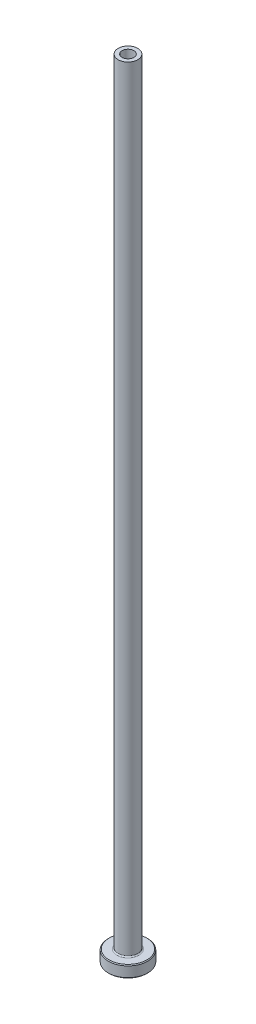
from build123d import *

# Parameters (mm, degrees)
FILLET1_R     = 0.3
CHAMFER1_SIZE = 0.2
CHAMFER3_SIZE = 0.5


with BuildPart() as part:
    # Sketch1 → Revolve1 (revolve)
    with BuildSketch(Plane.XY, mode=Mode.PRIVATE) as revolve1_sk:
        Polygon((-1.5, 200), (-2.5, 200), (-2.5, 3), (-5, 3), (-5, 0), (-1.75, 0), (-1.75, 143), (-1.5, 155), align=None)
    revolve(revolve1_sk.sketch.rotate(Axis((0, 92.187680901, 0), (0, -1, 0)), 270), axis=Axis((0, 92.187680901, 0), (0, -1, 0)))

    # Fillet1
    fillet1_edges = [part.edges().sort_by_distance(p)[0] for p in [
        (0, 3, -2.5),
    ]]
    fillet(fillet1_edges, radius=FILLET1_R)

    # Chamfer1
    chamfer1_edges = [part.edges().sort_by_distance(p)[0] for p in [
        (0, 0, -5),
        (0, 3, -5),
    ]]
    chamfer(chamfer1_edges, length=CHAMFER1_SIZE)

    # Chamfer3
    chamfer3_edges = [part.edges().sort_by_distance(p)[0] for p in [
        (0, 0, -1.75),
    ]]
    chamfer(chamfer3_edges, length=CHAMFER3_SIZE)


solid = part.part
